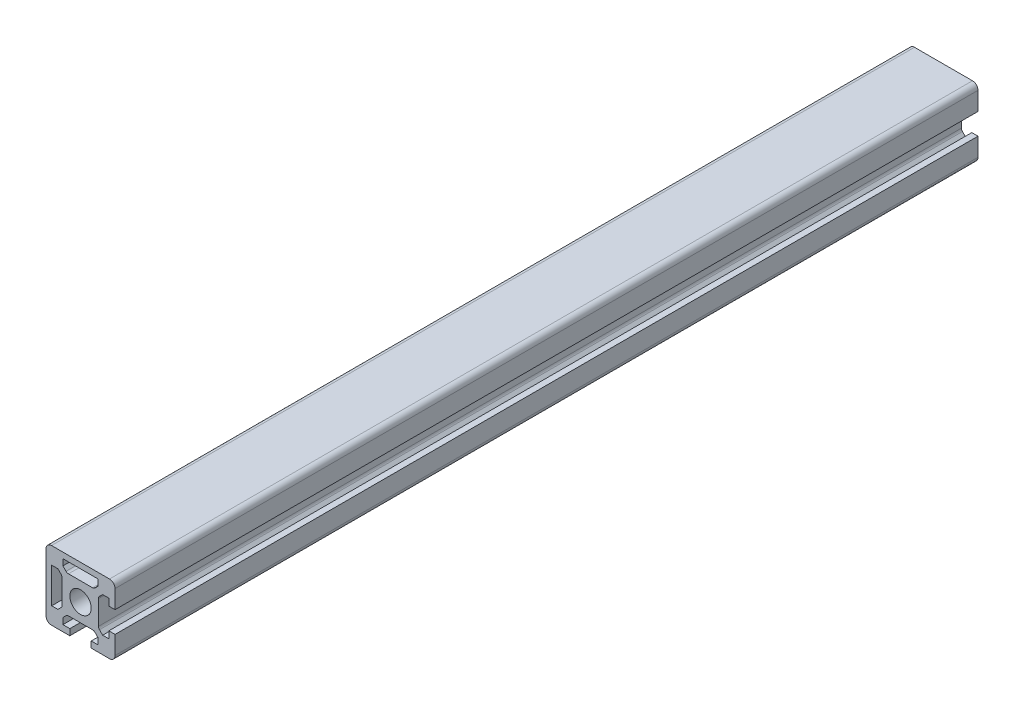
from build123d import *

# Parameters (mm, degrees)
ESQUISSE1_R        = 3.1
BOSS_EXTRU_1_DEPTH = 250


with BuildPart() as part:
    # Esquisse1 → Boss.-Extru.1 (new body)
    with BuildSketch(Plane.XY.offset(1)):
        with BuildLine():
            Line((-10, 8.4), (-10, -8.4))
            ThreePointArc((-10, -8.4), (-9.53137085, -9.53137085), (-8.4, -10))
            Line((-8.4, -10), (-3.1, -10))
            Line((-3.1, -10), (-3.1, -8.2))
            Line((-3.1, -8.2), (-5.1, -8.2))
            Line((-5.1, -8.2), (-5.1, -6.4))
            Line((-5.1, -6.4), (-4.192893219, -5.492893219))
            ThreePointArc((-4.192893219, -5.492893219), (-3.86846987, -5.276120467), (-3.485786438, -5.2))
            Line((-3.485786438, -5.2), (3.485786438, -5.2))
            ThreePointArc((3.485786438, -5.2), (3.86846987, -5.276120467), (4.192893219, -5.492893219))
            Line((4.192893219, -5.492893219), (5.1, -6.4))
            Line((5.1, -6.4), (5.1, -8.2))
            Line((5.1, -8.2), (3.1, -8.2))
            Line((3.1, -8.2), (3.1, -10))
            Line((3.1, -10), (8.4, -10))
            ThreePointArc((8.4, -10), (9.53137085, -9.53137085), (10, -8.4))
            Line((10, -8.4), (10, -3.1))
            Line((10, -3.1), (8.2, -3.1))
            Line((8.2, -3.1), (8.2, -5.1))
            Line((8.2, -5.1), (6.4, -5.1))
            Line((6.4, -5.1), (5.492893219, -4.192893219))
            ThreePointArc((5.492893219, -4.192893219), (5.276120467, -3.86846987), (5.2, -3.485786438))
            Line((5.2, -3.485786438), (5.2, 3.485786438))
            ThreePointArc((5.2, 3.485786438), (5.276120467, 3.86846987), (5.492893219, 4.192893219))
            Line((5.492893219, 4.192893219), (6.4, 5.1))
            Line((6.4, 5.1), (8.2, 5.1))
            Line((8.2, 5.1), (8.2, 3.1))
            Line((8.2, 3.1), (10, 3.1))
            Line((10, 3.1), (10, 8.4))
            ThreePointArc((10, 8.4), (9.53137085, 9.53137085), (8.4, 10))
            Line((8.4, 10), (-8.4, 10))
            ThreePointArc((-8.4, 10), (-9.53137085, 9.53137085), (-10, 8.4))
        make_face()
        with Locations(Location((0, 0, 0), (0, 0, 180))):
            Circle(ESQUISSE1_R, mode=Mode.SUBTRACT)
        with BuildLine():
            Line((3.485786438, 5.35), (-3.485786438, 5.35))
            ThreePointArc((-3.485786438, 5.35), (-3.86846987, 5.426120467), (-4.192893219, 5.642893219))
            Line((-4.192893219, 5.642893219), (-5.1, 6.55))
            Line((-5.1, 6.55), (-5.1, 8.35))
            Line((-5.1, 8.35), (5.1, 8.35))
            Line((5.1, 8.35), (5.1, 6.55))
            Line((5.1, 6.55), (4.192893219, 5.642893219))
            ThreePointArc((4.192893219, 5.642893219), (3.86846987, 5.426120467), (3.485786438, 5.35))
        make_face(mode=Mode.SUBTRACT)
        with BuildLine():
            Line((-5.35, 3.485786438), (-5.35, -3.485786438))
            ThreePointArc((-5.35, -3.485786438), (-5.426120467, -3.86846987), (-5.642893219, -4.192893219))
            Line((-5.642893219, -4.192893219), (-6.55, -5.1))
            Line((-6.55, -5.1), (-8.35, -5.1))
            Line((-8.35, -5.1), (-8.35, 5.1))
            Line((-8.35, 5.1), (-6.55, 5.1))
            Line((-6.55, 5.1), (-5.642893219, 4.192893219))
            ThreePointArc((-5.642893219, 4.192893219), (-5.426120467, 3.86846987), (-5.35, 3.485786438))
        make_face(mode=Mode.SUBTRACT)
    extrude(amount=-BOSS_EXTRU_1_DEPTH)


solid = part.part
